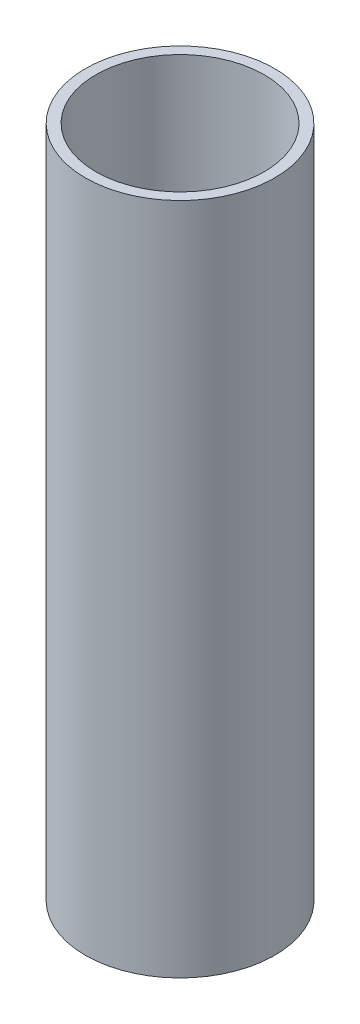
from build123d import *

# Parameters (mm, degrees)
SKETCH1_R           = 7.14375
SKETCH1_R_2         = 6.35
BOSS_EXTRUDE1_DEPTH = 50.8


with BuildPart() as part:
    # Sketch1 → Boss-Extrude1 (new body)
    with BuildSketch(Plane(origin=(0, 0, 0), x_dir=(1, 0, 0), z_dir=(0, 1, 0))):
        with Locations(Location((0, 0, 0), (0, 0, 270))):
            Circle(SKETCH1_R)
        with Locations(Location((0, 0, 0), (0, 0, 270))):
            Circle(SKETCH1_R_2, mode=Mode.SUBTRACT)
    extrude(amount=BOSS_EXTRUDE1_DEPTH)


solid = part.part
